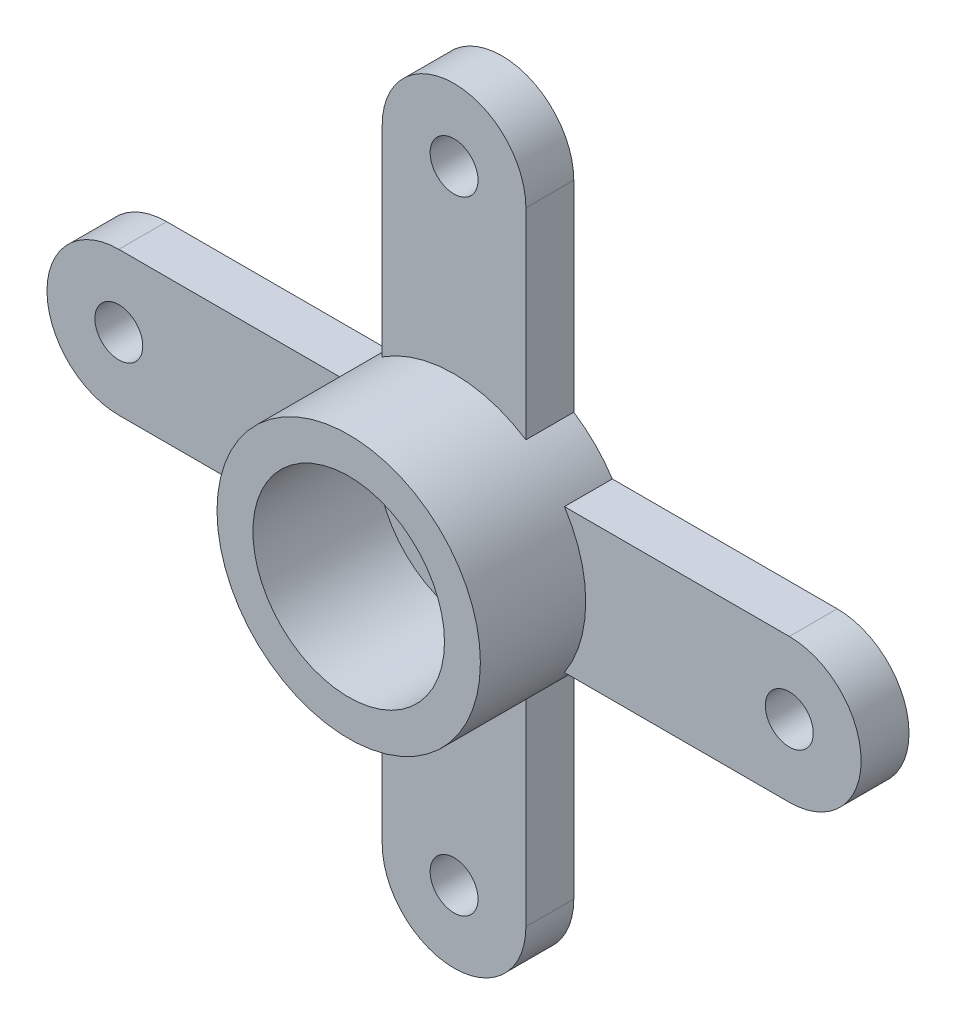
ISO-10303-21;
HEADER;
FILE_DESCRIPTION(('STEP AP214'),'2;1');
FILE_NAME('part.step','',(''),(''),'','','');
FILE_SCHEMA(('AUTOMOTIVE_DESIGN { 1 0 10303 214 1 1 1 1 }'));
ENDSEC;
DATA;
#1=APPLICATION_CONTEXT('core data for automotive mechanical design processes');
#2=APPLICATION_PROTOCOL_DEFINITION('international standard','automotive_design',2000,#1);
#3=PRODUCT_CONTEXT('',#1,'mechanical');
#4=PRODUCT('Part','Part','',(#3));
#5=PRODUCT_RELATED_PRODUCT_CATEGORY('part','',(#4));
#6=PRODUCT_DEFINITION_FORMATION('','',#4);
#7=PRODUCT_DEFINITION_CONTEXT('part definition',#1,'design');
#8=PRODUCT_DEFINITION('design','',#6,#7);
#9=PRODUCT_DEFINITION_SHAPE('','',#8);
#10=(LENGTH_UNIT() NAMED_UNIT(*) SI_UNIT(.MILLI.,.METRE.));
#11=(NAMED_UNIT(*) PLANE_ANGLE_UNIT() SI_UNIT($,.RADIAN.));
#12=(NAMED_UNIT(*) SI_UNIT($,.STERADIAN.) SOLID_ANGLE_UNIT());
#13=UNCERTAINTY_MEASURE_WITH_UNIT(LENGTH_MEASURE(1.E-05),#10,'distance_accuracy_value','');
#14=(GEOMETRIC_REPRESENTATION_CONTEXT(3) GLOBAL_UNCERTAINTY_ASSIGNED_CONTEXT((#13)) GLOBAL_UNIT_ASSIGNED_CONTEXT((#10,
#11,#12)) REPRESENTATION_CONTEXT('',''));
#15=CARTESIAN_POINT('',(0.,0.,0.));
#16=DIRECTION('',(0.,0.,1.));
#17=DIRECTION('',(1.,0.,0.));
#18=AXIS2_PLACEMENT_3D('',#15,#16,#17);
#19=CARTESIAN_POINT('',(0.,-6.5,1.));
#20=DIRECTION('',(0.,0.,1.));
#21=DIRECTION('',(1.,0.,0.));
#22=AXIS2_PLACEMENT_3D('',#19,#20,#21);
#23=PLANE('',#22);
#24=CARTESIAN_POINT('',(0.,0.,1.));
#25=DIRECTION('',(0.,0.,1.));
#26=DIRECTION('',(1.,0.,0.));
#27=AXIS2_PLACEMENT_3D('',#24,#25,#26);
#28=CIRCLE('',#27,2.75);
#29=CARTESIAN_POINT('',(1.5,2.30488611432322,1.));
#30=VERTEX_POINT('',#29);
#31=CARTESIAN_POINT('',(-1.5,2.30488611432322,1.));
#32=VERTEX_POINT('',#31);
#33=EDGE_CURVE('E191',#30,#32,#28,.T.);
#34=ORIENTED_EDGE('',*,*,#33,.F.);
#35=DIRECTION('',(0.,1.,0.));
#36=VECTOR('',#35,1.);
#37=CARTESIAN_POINT('',(1.5,1.5,1.));
#38=LINE('',#37,#36);
#39=CARTESIAN_POINT('',(1.5,6.5,1.));
#40=VERTEX_POINT('',#39);
#41=EDGE_CURVE('E231',#30,#40,#38,.T.);
#42=ORIENTED_EDGE('',*,*,#41,.T.);
#43=CARTESIAN_POINT('',(0.,6.5,1.));
#44=DIRECTION('',(0.,0.,1.));
#45=DIRECTION('',(1.,0.,0.));
#46=AXIS2_PLACEMENT_3D('',#43,#44,#45);
#47=CIRCLE('',#46,1.5);
#48=CARTESIAN_POINT('',(-1.5,6.5,1.));
#49=VERTEX_POINT('',#48);
#50=EDGE_CURVE('E233',#40,#49,#47,.T.);
#51=ORIENTED_EDGE('',*,*,#50,.T.);
#52=DIRECTION('',(0.,-1.,0.));
#53=VECTOR('',#52,1.);
#54=CARTESIAN_POINT('',(-1.5,1.5,1.));
#55=LINE('',#54,#53);
#56=EDGE_CURVE('E235',#49,#32,#55,.T.);
#57=ORIENTED_EDGE('',*,*,#56,.T.);
#58=EDGE_LOOP('',(#34,#42,#51,#57));
#59=FACE_BOUND('',#58,.T.);
#60=CARTESIAN_POINT('',(0.,6.5,1.));
#61=DIRECTION('',(0.,0.,1.));
#62=DIRECTION('',(1.,0.,0.));
#63=AXIS2_PLACEMENT_3D('',#60,#61,#62);
#64=CIRCLE('',#63,0.500000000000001);
#65=CARTESIAN_POINT('',(0.500000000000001,6.5,1.));
#66=VERTEX_POINT('',#65);
#67=EDGE_CURVE('E217',#66,#66,#64,.T.);
#68=ORIENTED_EDGE('',*,*,#67,.F.);
#69=EDGE_LOOP('',(#68));
#70=FACE_BOUND('',#69,.T.);
#71=ADVANCED_FACE('F34',(#59,#70),#23,.T.);
#72=CARTESIAN_POINT('',(-2.30488611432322,1.5,1.));
#73=VERTEX_POINT('',#72);
#74=CARTESIAN_POINT('',(-2.30488611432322,-1.5,1.));
#75=VERTEX_POINT('',#74);
#76=EDGE_CURVE('E184',#73,#75,#28,.T.);
#77=ORIENTED_EDGE('',*,*,#76,.F.);
#78=DIRECTION('',(-1.,0.,0.));
#79=VECTOR('',#78,1.);
#80=CARTESIAN_POINT('',(-7.,1.5,1.));
#81=LINE('',#80,#79);
#82=CARTESIAN_POINT('',(-7.,1.5,1.));
#83=VERTEX_POINT('',#82);
#84=EDGE_CURVE('E238',#73,#83,#81,.T.);
#85=ORIENTED_EDGE('',*,*,#84,.T.);
#86=CARTESIAN_POINT('',(-7.,0.,1.));
#87=DIRECTION('',(0.,0.,1.));
#88=DIRECTION('',(1.,0.,0.));
#89=AXIS2_PLACEMENT_3D('',#86,#87,#88);
#90=CIRCLE('',#89,1.5);
#91=CARTESIAN_POINT('',(-7.,-1.5,1.));
#92=VERTEX_POINT('',#91);
#93=EDGE_CURVE('E240',#83,#92,#90,.T.);
#94=ORIENTED_EDGE('',*,*,#93,.T.);
#95=DIRECTION('',(1.,0.,0.));
#96=VECTOR('',#95,1.);
#97=CARTESIAN_POINT('',(-7.,-1.5,1.));
#98=LINE('',#97,#96);
#99=EDGE_CURVE('E242',#92,#75,#98,.T.);
#100=ORIENTED_EDGE('',*,*,#99,.T.);
#101=EDGE_LOOP('',(#77,#85,#94,#100));
#102=FACE_BOUND('',#101,.T.);
#103=CARTESIAN_POINT('',(-7.,0.,1.));
#104=DIRECTION('',(0.,0.,1.));
#105=DIRECTION('',(1.,0.,0.));
#106=AXIS2_PLACEMENT_3D('',#103,#104,#105);
#107=CIRCLE('',#106,0.500000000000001);
#108=CARTESIAN_POINT('',(-6.5,0.,1.));
#109=VERTEX_POINT('',#108);
#110=EDGE_CURVE('E211',#109,#109,#107,.T.);
#111=ORIENTED_EDGE('',*,*,#110,.F.);
#112=EDGE_LOOP('',(#111));
#113=FACE_BOUND('',#112,.T.);
#114=ADVANCED_FACE('F312',(#102,#113),#23,.T.);
#115=CARTESIAN_POINT('',(-1.5,-2.30488611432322,1.));
#116=VERTEX_POINT('',#115);
#117=CARTESIAN_POINT('',(1.5,-2.30488611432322,1.));
#118=VERTEX_POINT('',#117);
#119=EDGE_CURVE('E175',#116,#118,#28,.T.);
#120=ORIENTED_EDGE('',*,*,#119,.F.);
#121=DIRECTION('',(0.,-1.,0.));
#122=VECTOR('',#121,1.);
#123=CARTESIAN_POINT('',(-1.5,-1.5,1.));
#124=LINE('',#123,#122);
#125=CARTESIAN_POINT('',(-1.5,-6.5,1.));
#126=VERTEX_POINT('',#125);
#127=EDGE_CURVE('E163',#116,#126,#124,.T.);
#128=ORIENTED_EDGE('',*,*,#127,.T.);
#129=CARTESIAN_POINT('',(0.,-6.5,1.));
#130=DIRECTION('',(0.,0.,1.));
#131=DIRECTION('',(1.,0.,0.));
#132=AXIS2_PLACEMENT_3D('',#129,#130,#131);
#133=CIRCLE('',#132,1.5);
#134=CARTESIAN_POINT('',(1.5,-6.5,1.));
#135=VERTEX_POINT('',#134);
#136=EDGE_CURVE('E246',#126,#135,#133,.T.);
#137=ORIENTED_EDGE('',*,*,#136,.T.);
#138=DIRECTION('',(0.,1.,0.));
#139=VECTOR('',#138,1.);
#140=CARTESIAN_POINT('',(1.5,-1.5,1.));
#141=LINE('',#140,#139);
#142=EDGE_CURVE('E222',#135,#118,#141,.T.);
#143=ORIENTED_EDGE('',*,*,#142,.T.);
#144=EDGE_LOOP('',(#120,#128,#137,#143));
#145=FACE_BOUND('',#144,.T.);
#146=CARTESIAN_POINT('',(0.,-6.5,1.));
#147=DIRECTION('',(0.,0.,1.));
#148=DIRECTION('',(1.,0.,0.));
#149=AXIS2_PLACEMENT_3D('',#146,#147,#148);
#150=CIRCLE('',#149,0.500000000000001);
#151=CARTESIAN_POINT('',(0.500000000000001,-6.5,1.));
#152=VERTEX_POINT('',#151);
#153=EDGE_CURVE('E199',#152,#152,#150,.T.);
#154=ORIENTED_EDGE('',*,*,#153,.F.);
#155=EDGE_LOOP('',(#154));
#156=FACE_BOUND('',#155,.T.);
#157=ADVANCED_FACE('F355',(#145,#156),#23,.T.);
#158=CARTESIAN_POINT('',(2.30488611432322,-1.5,1.));
#159=VERTEX_POINT('',#158);
#160=CARTESIAN_POINT('',(2.30488611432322,1.5,1.));
#161=VERTEX_POINT('',#160);
#162=EDGE_CURVE('E183',#159,#161,#28,.T.);
#163=ORIENTED_EDGE('',*,*,#162,.F.);
#164=DIRECTION('',(1.,0.,0.));
#165=VECTOR('',#164,1.);
#166=CARTESIAN_POINT('',(7.,-1.5,1.));
#167=LINE('',#166,#165);
#168=CARTESIAN_POINT('',(7.,-1.5,1.));
#169=VERTEX_POINT('',#168);
#170=EDGE_CURVE('E224',#159,#169,#167,.T.);
#171=ORIENTED_EDGE('',*,*,#170,.T.);
#172=CARTESIAN_POINT('',(7.,0.,1.));
#173=DIRECTION('',(0.,0.,1.));
#174=DIRECTION('',(1.,0.,0.));
#175=AXIS2_PLACEMENT_3D('',#172,#173,#174);
#176=CIRCLE('',#175,1.5);
#177=CARTESIAN_POINT('',(7.,1.5,1.));
#178=VERTEX_POINT('',#177);
#179=EDGE_CURVE('E226',#169,#178,#176,.T.);
#180=ORIENTED_EDGE('',*,*,#179,.T.);
#181=DIRECTION('',(-1.,0.,0.));
#182=VECTOR('',#181,1.);
#183=CARTESIAN_POINT('',(1.5,1.5,1.));
#184=LINE('',#183,#182);
#185=EDGE_CURVE('E228',#178,#161,#184,.T.);
#186=ORIENTED_EDGE('',*,*,#185,.T.);
#187=EDGE_LOOP('',(#163,#171,#180,#186));
#188=FACE_BOUND('',#187,.T.);
#189=CARTESIAN_POINT('',(7.,0.,1.));
#190=DIRECTION('',(0.,0.,1.));
#191=DIRECTION('',(1.,0.,0.));
#192=AXIS2_PLACEMENT_3D('',#189,#190,#191);
#193=CIRCLE('',#192,0.500000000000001);
#194=CARTESIAN_POINT('',(7.5,0.,1.));
#195=VERTEX_POINT('',#194);
#196=EDGE_CURVE('E205',#195,#195,#193,.T.);
#197=ORIENTED_EDGE('',*,*,#196,.F.);
#198=EDGE_LOOP('',(#197));
#199=FACE_BOUND('',#198,.T.);
#200=ADVANCED_FACE('F351',(#188,#199),#23,.T.);
#201=CARTESIAN_POINT('',(0.,-6.5,0.));
#202=DIRECTION('',(0.,0.,1.));
#203=DIRECTION('',(1.,0.,0.));
#204=AXIS2_PLACEMENT_3D('',#201,#202,#203);
#205=PLANE('',#204);
#206=CARTESIAN_POINT('',(7.,0.,0.));
#207=DIRECTION('',(0.,0.,1.));
#208=DIRECTION('',(1.,0.,0.));
#209=AXIS2_PLACEMENT_3D('',#206,#207,#208);
#210=CIRCLE('',#209,0.500000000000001);
#211=CARTESIAN_POINT('',(7.5,0.,0.));
#212=VERTEX_POINT('',#211);
#213=EDGE_CURVE('E202',#212,#212,#210,.T.);
#214=ORIENTED_EDGE('',*,*,#213,.T.);
#215=EDGE_LOOP('',(#214));
#216=FACE_BOUND('',#215,.T.);
#217=DIRECTION('',(1.,0.,0.));
#218=VECTOR('',#217,1.);
#219=CARTESIAN_POINT('',(7.,-1.5,0.));
#220=LINE('',#219,#218);
#221=CARTESIAN_POINT('',(2.30488611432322,-1.5,0.));
#222=VERTEX_POINT('',#221);
#223=CARTESIAN_POINT('',(7.,-1.5,0.));
#224=VERTEX_POINT('',#223);
#225=EDGE_CURVE('E250',#222,#224,#220,.T.);
#226=ORIENTED_EDGE('',*,*,#225,.F.);
#227=CARTESIAN_POINT('',(0.,0.,0.));
#228=DIRECTION('',(0.,0.,1.));
#229=DIRECTION('',(1.,0.,0.));
#230=AXIS2_PLACEMENT_3D('',#227,#228,#229);
#231=CIRCLE('',#230,2.75);
#232=CARTESIAN_POINT('',(1.5,-2.30488611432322,0.));
#233=VERTEX_POINT('',#232);
#234=EDGE_CURVE('E171',#222,#233,#231,.F.);
#235=ORIENTED_EDGE('',*,*,#234,.T.);
#236=DIRECTION('',(0.,1.,0.));
#237=VECTOR('',#236,1.);
#238=CARTESIAN_POINT('',(1.5,-1.5,0.));
#239=LINE('',#238,#237);
#240=CARTESIAN_POINT('',(1.5,-6.5,0.));
#241=VERTEX_POINT('',#240);
#242=EDGE_CURVE('E54',#241,#233,#239,.T.);
#243=ORIENTED_EDGE('',*,*,#242,.F.);
#244=CARTESIAN_POINT('',(0.,-6.5,0.));
#245=DIRECTION('',(0.,0.,1.));
#246=DIRECTION('',(1.,0.,0.));
#247=AXIS2_PLACEMENT_3D('',#244,#245,#246);
#248=CIRCLE('',#247,1.5);
#249=CARTESIAN_POINT('',(-1.5,-6.5,0.));
#250=VERTEX_POINT('',#249);
#251=EDGE_CURVE('E154',#250,#241,#248,.T.);
#252=ORIENTED_EDGE('',*,*,#251,.F.);
#253=DIRECTION('',(0.,-1.,0.));
#254=VECTOR('',#253,1.);
#255=CARTESIAN_POINT('',(-1.5,-1.5,0.));
#256=LINE('',#255,#254);
#257=CARTESIAN_POINT('',(-1.5,-2.30488611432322,0.));
#258=VERTEX_POINT('',#257);
#259=EDGE_CURVE('E147',#258,#250,#256,.T.);
#260=ORIENTED_EDGE('',*,*,#259,.F.);
#261=CARTESIAN_POINT('',(-2.30488611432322,-1.5,0.));
#262=VERTEX_POINT('',#261);
#263=EDGE_CURVE('E153',#258,#262,#231,.F.);
#264=ORIENTED_EDGE('',*,*,#263,.T.);
#265=DIRECTION('',(1.,0.,0.));
#266=VECTOR('',#265,1.);
#267=CARTESIAN_POINT('',(-7.,-1.5,0.));
#268=LINE('',#267,#266);
#269=CARTESIAN_POINT('',(-7.,-1.5,0.));
#270=VERTEX_POINT('',#269);
#271=EDGE_CURVE('E158',#270,#262,#268,.T.);
#272=ORIENTED_EDGE('',*,*,#271,.F.);
#273=CARTESIAN_POINT('',(-7.,0.,0.));
#274=DIRECTION('',(0.,0.,1.));
#275=DIRECTION('',(1.,0.,0.));
#276=AXIS2_PLACEMENT_3D('',#273,#274,#275);
#277=CIRCLE('',#276,1.5);
#278=CARTESIAN_POINT('',(-7.,1.5,0.));
#279=VERTEX_POINT('',#278);
#280=EDGE_CURVE('E264',#279,#270,#277,.T.);
#281=ORIENTED_EDGE('',*,*,#280,.F.);
#282=DIRECTION('',(-1.,0.,0.));
#283=VECTOR('',#282,1.);
#284=CARTESIAN_POINT('',(-7.,1.5,0.));
#285=LINE('',#284,#283);
#286=CARTESIAN_POINT('',(-2.30488611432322,1.5,0.));
#287=VERTEX_POINT('',#286);
#288=EDGE_CURVE('E262',#287,#279,#285,.T.);
#289=ORIENTED_EDGE('',*,*,#288,.F.);
#290=CARTESIAN_POINT('',(-1.5,2.30488611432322,0.));
#291=VERTEX_POINT('',#290);
#292=EDGE_CURVE('E172',#287,#291,#231,.F.);
#293=ORIENTED_EDGE('',*,*,#292,.T.);
#294=DIRECTION('',(0.,-1.,0.));
#295=VECTOR('',#294,1.);
#296=CARTESIAN_POINT('',(-1.5,1.5,0.));
#297=LINE('',#296,#295);
#298=CARTESIAN_POINT('',(-1.5,6.5,0.));
#299=VERTEX_POINT('',#298);
#300=EDGE_CURVE('E260',#299,#291,#297,.T.);
#301=ORIENTED_EDGE('',*,*,#300,.F.);
#302=CARTESIAN_POINT('',(0.,6.5,0.));
#303=DIRECTION('',(0.,0.,1.));
#304=DIRECTION('',(1.,0.,0.));
#305=AXIS2_PLACEMENT_3D('',#302,#303,#304);
#306=CIRCLE('',#305,1.5);
#307=CARTESIAN_POINT('',(1.5,6.5,0.));
#308=VERTEX_POINT('',#307);
#309=EDGE_CURVE('E258',#308,#299,#306,.T.);
#310=ORIENTED_EDGE('',*,*,#309,.F.);
#311=DIRECTION('',(0.,1.,0.));
#312=VECTOR('',#311,1.);
#313=CARTESIAN_POINT('',(1.5,1.5,0.));
#314=LINE('',#313,#312);
#315=CARTESIAN_POINT('',(1.5,2.30488611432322,0.));
#316=VERTEX_POINT('',#315);
#317=EDGE_CURVE('E256',#316,#308,#314,.T.);
#318=ORIENTED_EDGE('',*,*,#317,.F.);
#319=CARTESIAN_POINT('',(2.30488611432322,1.5,0.));
#320=VERTEX_POINT('',#319);
#321=EDGE_CURVE('E176',#316,#320,#231,.F.);
#322=ORIENTED_EDGE('',*,*,#321,.T.);
#323=DIRECTION('',(-1.,0.,0.));
#324=VECTOR('',#323,1.);
#325=CARTESIAN_POINT('',(1.5,1.5,0.));
#326=LINE('',#325,#324);
#327=CARTESIAN_POINT('',(7.,1.5,0.));
#328=VERTEX_POINT('',#327);
#329=EDGE_CURVE('E254',#328,#320,#326,.T.);
#330=ORIENTED_EDGE('',*,*,#329,.F.);
#331=CARTESIAN_POINT('',(7.,0.,0.));
#332=DIRECTION('',(0.,0.,1.));
#333=DIRECTION('',(1.,0.,0.));
#334=AXIS2_PLACEMENT_3D('',#331,#332,#333);
#335=CIRCLE('',#334,1.5);
#336=EDGE_CURVE('E252',#224,#328,#335,.T.);
#337=ORIENTED_EDGE('',*,*,#336,.F.);
#338=EDGE_LOOP('',(#226,#235,#243,#252,#260,#264,#272,#281,#289,#293,#301,#310,#318,#322,#330,#337));
#339=FACE_BOUND('',#338,.T.);
#340=CARTESIAN_POINT('',(0.,-6.5,0.));
#341=DIRECTION('',(0.,0.,1.));
#342=DIRECTION('',(1.,0.,0.));
#343=AXIS2_PLACEMENT_3D('',#340,#341,#342);
#344=CIRCLE('',#343,0.500000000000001);
#345=CARTESIAN_POINT('',(0.500000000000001,-6.5,0.));
#346=VERTEX_POINT('',#345);
#347=EDGE_CURVE('E198',#346,#346,#344,.T.);
#348=ORIENTED_EDGE('',*,*,#347,.T.);
#349=EDGE_LOOP('',(#348));
#350=FACE_BOUND('',#349,.T.);
#351=CARTESIAN_POINT('',(-7.,0.,0.));
#352=DIRECTION('',(0.,0.,1.));
#353=DIRECTION('',(1.,0.,0.));
#354=AXIS2_PLACEMENT_3D('',#351,#352,#353);
#355=CIRCLE('',#354,0.500000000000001);
#356=CARTESIAN_POINT('',(-6.5,0.,0.));
#357=VERTEX_POINT('',#356);
#358=EDGE_CURVE('E208',#357,#357,#355,.T.);
#359=ORIENTED_EDGE('',*,*,#358,.T.);
#360=EDGE_LOOP('',(#359));
#361=FACE_BOUND('',#360,.T.);
#362=CARTESIAN_POINT('',(0.,6.5,0.));
#363=DIRECTION('',(0.,0.,1.));
#364=DIRECTION('',(1.,0.,0.));
#365=AXIS2_PLACEMENT_3D('',#362,#363,#364);
#366=CIRCLE('',#365,0.500000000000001);
#367=CARTESIAN_POINT('',(0.500000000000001,6.5,0.));
#368=VERTEX_POINT('',#367);
#369=EDGE_CURVE('E214',#368,#368,#366,.T.);
#370=ORIENTED_EDGE('',*,*,#369,.T.);
#371=EDGE_LOOP('',(#370));
#372=FACE_BOUND('',#371,.T.);
#373=ADVANCED_FACE('F149',(#216,#339,#350,#361,#372),#205,.F.);
#374=CARTESIAN_POINT('',(1.5,-1.5,1.));
#375=DIRECTION('',(-1.,0.,0.));
#376=DIRECTION('',(0.,0.,1.));
#377=AXIS2_PLACEMENT_3D('',#374,#375,#376);
#378=PLANE('',#377);
#379=ORIENTED_EDGE('',*,*,#242,.T.);
#380=DIRECTION('',(0.,0.,1.));
#381=VECTOR('',#380,1.);
#382=CARTESIAN_POINT('',(1.5,-2.30488611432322,-7.77817459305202));
#383=LINE('',#382,#381);
#384=EDGE_CURVE('E49',#233,#118,#383,.T.);
#385=ORIENTED_EDGE('',*,*,#384,.T.);
#386=ORIENTED_EDGE('',*,*,#142,.F.);
#387=DIRECTION('',(0.,0.,-1.));
#388=VECTOR('',#387,1.);
#389=CARTESIAN_POINT('',(1.5,-6.5,1.));
#390=LINE('',#389,#388);
#391=EDGE_CURVE('E248',#135,#241,#390,.T.);
#392=ORIENTED_EDGE('',*,*,#391,.T.);
#393=EDGE_LOOP('',(#379,#385,#386,#392));
#394=FACE_BOUND('',#393,.T.);
#395=ADVANCED_FACE('F36',(#394),#378,.F.);
#396=CARTESIAN_POINT('',(7.,-1.5,1.));
#397=DIRECTION('',(0.,1.,0.));
#398=DIRECTION('',(-1.,0.,0.));
#399=AXIS2_PLACEMENT_3D('',#396,#397,#398);
#400=PLANE('',#399);
#401=ORIENTED_EDGE('',*,*,#170,.F.);
#402=DIRECTION('',(0.,0.,1.));
#403=VECTOR('',#402,1.);
#404=CARTESIAN_POINT('',(2.30488611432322,-1.5,-7.77817459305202));
#405=LINE('',#404,#403);
#406=EDGE_CURVE('E196',#159,#222,#405,.F.);
#407=ORIENTED_EDGE('',*,*,#406,.T.);
#408=ORIENTED_EDGE('',*,*,#225,.T.);
#409=DIRECTION('',(0.,0.,-1.));
#410=VECTOR('',#409,1.);
#411=CARTESIAN_POINT('',(7.,-1.5,1.));
#412=LINE('',#411,#410);
#413=EDGE_CURVE('E42',#169,#224,#412,.T.);
#414=ORIENTED_EDGE('',*,*,#413,.F.);
#415=EDGE_LOOP('',(#401,#407,#408,#414));
#416=FACE_BOUND('',#415,.T.);
#417=ADVANCED_FACE('F524',(#416),#400,.F.);
#418=CARTESIAN_POINT('',(7.,0.,1.));
#419=DIRECTION('',(0.,0.,-1.));
#420=DIRECTION('',(-1.,0.,0.));
#421=AXIS2_PLACEMENT_3D('',#418,#419,#420);
#422=CYLINDRICAL_SURFACE('',#421,1.5);
#423=ORIENTED_EDGE('',*,*,#336,.T.);
#424=DIRECTION('',(0.,0.,-1.));
#425=VECTOR('',#424,1.);
#426=CARTESIAN_POINT('',(7.,1.5,1.));
#427=LINE('',#426,#425);
#428=EDGE_CURVE('E283',#178,#328,#427,.T.);
#429=ORIENTED_EDGE('',*,*,#428,.F.);
#430=ORIENTED_EDGE('',*,*,#179,.F.);
#431=ORIENTED_EDGE('',*,*,#413,.T.);
#432=EDGE_LOOP('',(#423,#429,#430,#431));
#433=FACE_BOUND('',#432,.T.);
#434=ADVANCED_FACE('F290',(#433),#422,.T.);
#435=CARTESIAN_POINT('',(1.5,1.5,1.));
#436=DIRECTION('',(0.,-1.,0.));
#437=DIRECTION('',(1.,0.,0.));
#438=AXIS2_PLACEMENT_3D('',#435,#436,#437);
#439=PLANE('',#438);
#440=ORIENTED_EDGE('',*,*,#329,.T.);
#441=DIRECTION('',(0.,0.,1.));
#442=VECTOR('',#441,1.);
#443=CARTESIAN_POINT('',(2.30488611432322,1.5,-7.77817459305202));
#444=LINE('',#443,#442);
#445=EDGE_CURVE('E194',#320,#161,#444,.T.);
#446=ORIENTED_EDGE('',*,*,#445,.T.);
#447=ORIENTED_EDGE('',*,*,#185,.F.);
#448=ORIENTED_EDGE('',*,*,#428,.T.);
#449=EDGE_LOOP('',(#440,#446,#447,#448));
#450=FACE_BOUND('',#449,.T.);
#451=ADVANCED_FACE('F301',(#450),#439,.F.);
#452=CARTESIAN_POINT('',(1.5,1.5,1.));
#453=DIRECTION('',(-1.,0.,0.));
#454=DIRECTION('',(0.,0.,1.));
#455=AXIS2_PLACEMENT_3D('',#452,#453,#454);
#456=PLANE('',#455);
#457=ORIENTED_EDGE('',*,*,#41,.F.);
#458=DIRECTION('',(0.,0.,1.));
#459=VECTOR('',#458,1.);
#460=CARTESIAN_POINT('',(1.5,2.30488611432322,-7.77817459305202));
#461=LINE('',#460,#459);
#462=EDGE_CURVE('E192',#30,#316,#461,.F.);
#463=ORIENTED_EDGE('',*,*,#462,.T.);
#464=ORIENTED_EDGE('',*,*,#317,.T.);
#465=DIRECTION('',(0.,0.,-1.));
#466=VECTOR('',#465,1.);
#467=CARTESIAN_POINT('',(1.5,6.5,1.));
#468=LINE('',#467,#466);
#469=EDGE_CURVE('E280',#40,#308,#468,.T.);
#470=ORIENTED_EDGE('',*,*,#469,.F.);
#471=EDGE_LOOP('',(#457,#463,#464,#470));
#472=FACE_BOUND('',#471,.T.);
#473=ADVANCED_FACE('F340',(#472),#456,.F.);
#474=CARTESIAN_POINT('',(0.,6.5,1.));
#475=DIRECTION('',(0.,0.,-1.));
#476=DIRECTION('',(-1.,0.,0.));
#477=AXIS2_PLACEMENT_3D('',#474,#475,#476);
#478=CYLINDRICAL_SURFACE('',#477,1.5);
#479=ORIENTED_EDGE('',*,*,#309,.T.);
#480=DIRECTION('',(0.,0.,-1.));
#481=VECTOR('',#480,1.);
#482=CARTESIAN_POINT('',(-1.5,6.5,1.));
#483=LINE('',#482,#481);
#484=EDGE_CURVE('E277',#49,#299,#483,.T.);
#485=ORIENTED_EDGE('',*,*,#484,.F.);
#486=ORIENTED_EDGE('',*,*,#50,.F.);
#487=ORIENTED_EDGE('',*,*,#469,.T.);
#488=EDGE_LOOP('',(#479,#485,#486,#487));
#489=FACE_BOUND('',#488,.T.);
#490=ADVANCED_FACE('F337',(#489),#478,.T.);
#491=CARTESIAN_POINT('',(-1.5,1.5,1.));
#492=DIRECTION('',(1.,0.,0.));
#493=DIRECTION('',(0.,0.,-1.));
#494=AXIS2_PLACEMENT_3D('',#491,#492,#493);
#495=PLANE('',#494);
#496=ORIENTED_EDGE('',*,*,#300,.T.);
#497=DIRECTION('',(0.,0.,1.));
#498=VECTOR('',#497,1.);
#499=CARTESIAN_POINT('',(-1.5,2.30488611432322,-7.77817459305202));
#500=LINE('',#499,#498);
#501=EDGE_CURVE('E189',#291,#32,#500,.T.);
#502=ORIENTED_EDGE('',*,*,#501,.T.);
#503=ORIENTED_EDGE('',*,*,#56,.F.);
#504=ORIENTED_EDGE('',*,*,#484,.T.);
#505=EDGE_LOOP('',(#496,#502,#503,#504));
#506=FACE_BOUND('',#505,.T.);
#507=ADVANCED_FACE('F329',(#506),#495,.F.);
#508=CARTESIAN_POINT('',(-7.,1.5,1.));
#509=DIRECTION('',(0.,-1.,0.));
#510=DIRECTION('',(0.,0.,-1.));
#511=AXIS2_PLACEMENT_3D('',#508,#509,#510);
#512=PLANE('',#511);
#513=ORIENTED_EDGE('',*,*,#84,.F.);
#514=DIRECTION('',(0.,0.,1.));
#515=VECTOR('',#514,1.);
#516=CARTESIAN_POINT('',(-2.30488611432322,1.5,-7.77817459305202));
#517=LINE('',#516,#515);
#518=EDGE_CURVE('E187',#73,#287,#517,.F.);
#519=ORIENTED_EDGE('',*,*,#518,.T.);
#520=ORIENTED_EDGE('',*,*,#288,.T.);
#521=DIRECTION('',(0.,0.,-1.));
#522=VECTOR('',#521,1.);
#523=CARTESIAN_POINT('',(-7.,1.5,1.));
#524=LINE('',#523,#522);
#525=EDGE_CURVE('E274',#83,#279,#524,.T.);
#526=ORIENTED_EDGE('',*,*,#525,.F.);
#527=EDGE_LOOP('',(#513,#519,#520,#526));
#528=FACE_BOUND('',#527,.T.);
#529=ADVANCED_FACE('F317',(#528),#512,.F.);
#530=CARTESIAN_POINT('',(-7.,0.,1.));
#531=DIRECTION('',(0.,0.,-1.));
#532=DIRECTION('',(-1.,0.,0.));
#533=AXIS2_PLACEMENT_3D('',#530,#531,#532);
#534=CYLINDRICAL_SURFACE('',#533,1.5);
#535=ORIENTED_EDGE('',*,*,#280,.T.);
#536=DIRECTION('',(0.,0.,-1.));
#537=VECTOR('',#536,1.);
#538=CARTESIAN_POINT('',(-7.,-1.5,1.));
#539=LINE('',#538,#537);
#540=EDGE_CURVE('E271',#92,#270,#539,.T.);
#541=ORIENTED_EDGE('',*,*,#540,.F.);
#542=ORIENTED_EDGE('',*,*,#93,.F.);
#543=ORIENTED_EDGE('',*,*,#525,.T.);
#544=EDGE_LOOP('',(#535,#541,#542,#543));
#545=FACE_BOUND('',#544,.T.);
#546=ADVANCED_FACE('F323',(#545),#534,.T.);
#547=CARTESIAN_POINT('',(-7.,-1.5,1.));
#548=DIRECTION('',(0.,1.,0.));
#549=DIRECTION('',(0.,0.,1.));
#550=AXIS2_PLACEMENT_3D('',#547,#548,#549);
#551=PLANE('',#550);
#552=ORIENTED_EDGE('',*,*,#271,.T.);
#553=DIRECTION('',(0.,0.,1.));
#554=VECTOR('',#553,1.);
#555=CARTESIAN_POINT('',(-2.30488611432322,-1.5,-7.77817459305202));
#556=LINE('',#555,#554);
#557=EDGE_CURVE('E170',#262,#75,#556,.T.);
#558=ORIENTED_EDGE('',*,*,#557,.T.);
#559=ORIENTED_EDGE('',*,*,#99,.F.);
#560=ORIENTED_EDGE('',*,*,#540,.T.);
#561=EDGE_LOOP('',(#552,#558,#559,#560));
#562=FACE_BOUND('',#561,.T.);
#563=ADVANCED_FACE('F325',(#562),#551,.F.);
#564=CARTESIAN_POINT('',(-1.5,-1.5,1.));
#565=DIRECTION('',(1.,0.,0.));
#566=DIRECTION('',(0.,0.,-1.));
#567=AXIS2_PLACEMENT_3D('',#564,#565,#566);
#568=PLANE('',#567);
#569=ORIENTED_EDGE('',*,*,#127,.F.);
#570=DIRECTION('',(0.,0.,1.));
#571=VECTOR('',#570,1.);
#572=CARTESIAN_POINT('',(-1.5,-2.30488611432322,-7.77817459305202));
#573=LINE('',#572,#571);
#574=EDGE_CURVE('E11',#116,#258,#573,.F.);
#575=ORIENTED_EDGE('',*,*,#574,.T.);
#576=ORIENTED_EDGE('',*,*,#259,.T.);
#577=DIRECTION('',(0.,0.,-1.));
#578=VECTOR('',#577,1.);
#579=CARTESIAN_POINT('',(-1.5,-6.5,1.));
#580=LINE('',#579,#578);
#581=EDGE_CURVE('E269',#126,#250,#580,.T.);
#582=ORIENTED_EDGE('',*,*,#581,.F.);
#583=EDGE_LOOP('',(#569,#575,#576,#582));
#584=FACE_BOUND('',#583,.T.);
#585=ADVANCED_FACE('F162',(#584),#568,.F.);
#586=CARTESIAN_POINT('',(0.,-6.5,1.));
#587=DIRECTION('',(0.,0.,-1.));
#588=DIRECTION('',(-1.,0.,0.));
#589=AXIS2_PLACEMENT_3D('',#586,#587,#588);
#590=CYLINDRICAL_SURFACE('',#589,1.5);
#591=ORIENTED_EDGE('',*,*,#251,.T.);
#592=ORIENTED_EDGE('',*,*,#391,.F.);
#593=ORIENTED_EDGE('',*,*,#136,.F.);
#594=ORIENTED_EDGE('',*,*,#581,.T.);
#595=EDGE_LOOP('',(#591,#592,#593,#594));
#596=FACE_BOUND('',#595,.T.);
#597=ADVANCED_FACE('F386',(#596),#590,.T.);
#598=CARTESIAN_POINT('',(0.,6.5,1.));
#599=DIRECTION('',(0.,0.,-1.));
#600=DIRECTION('',(-1.,0.,0.));
#601=AXIS2_PLACEMENT_3D('',#598,#599,#600);
#602=CYLINDRICAL_SURFACE('',#601,0.500000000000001);
#603=ORIENTED_EDGE('',*,*,#67,.T.);
#604=EDGE_LOOP('',(#603));
#605=FACE_BOUND('',#604,.T.);
#606=ORIENTED_EDGE('',*,*,#369,.F.);
#607=EDGE_LOOP('',(#606));
#608=FACE_BOUND('',#607,.T.);
#609=ADVANCED_FACE('F381',(#605,#608),#602,.F.);
#610=CARTESIAN_POINT('',(-7.,0.,1.));
#611=DIRECTION('',(0.,0.,-1.));
#612=DIRECTION('',(-1.,0.,0.));
#613=AXIS2_PLACEMENT_3D('',#610,#611,#612);
#614=CYLINDRICAL_SURFACE('',#613,0.500000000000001);
#615=ORIENTED_EDGE('',*,*,#110,.T.);
#616=EDGE_LOOP('',(#615));
#617=FACE_BOUND('',#616,.T.);
#618=ORIENTED_EDGE('',*,*,#358,.F.);
#619=EDGE_LOOP('',(#618));
#620=FACE_BOUND('',#619,.T.);
#621=ADVANCED_FACE('F372',(#617,#620),#614,.F.);
#622=CARTESIAN_POINT('',(7.,0.,1.));
#623=DIRECTION('',(0.,0.,-1.));
#624=DIRECTION('',(-1.,0.,0.));
#625=AXIS2_PLACEMENT_3D('',#622,#623,#624);
#626=CYLINDRICAL_SURFACE('',#625,0.500000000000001);
#627=ORIENTED_EDGE('',*,*,#196,.T.);
#628=EDGE_LOOP('',(#627));
#629=FACE_BOUND('',#628,.T.);
#630=ORIENTED_EDGE('',*,*,#213,.F.);
#631=EDGE_LOOP('',(#630));
#632=FACE_BOUND('',#631,.T.);
#633=ADVANCED_FACE('F368',(#629,#632),#626,.F.);
#634=CARTESIAN_POINT('',(0.,-6.5,1.));
#635=DIRECTION('',(0.,0.,-1.));
#636=DIRECTION('',(-1.,0.,0.));
#637=AXIS2_PLACEMENT_3D('',#634,#635,#636);
#638=CYLINDRICAL_SURFACE('',#637,0.500000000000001);
#639=ORIENTED_EDGE('',*,*,#153,.T.);
#640=EDGE_LOOP('',(#639));
#641=FACE_BOUND('',#640,.T.);
#642=ORIENTED_EDGE('',*,*,#347,.F.);
#643=EDGE_LOOP('',(#642));
#644=FACE_BOUND('',#643,.T.);
#645=ADVANCED_FACE('F371',(#641,#644),#638,.F.);
#646=CARTESIAN_POINT('',(0.,0.,-7.77817459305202));
#647=DIRECTION('',(0.,0.,1.));
#648=DIRECTION('',(1.,0.,0.));
#649=AXIS2_PLACEMENT_3D('',#646,#647,#648);
#650=CYLINDRICAL_SURFACE('',#649,2.75);
#651=CARTESIAN_POINT('',(0.,0.,3.2));
#652=DIRECTION('',(0.,0.,1.));
#653=DIRECTION('',(1.,0.,0.));
#654=AXIS2_PLACEMENT_3D('',#651,#652,#653);
#655=CIRCLE('',#654,2.75);
#656=CARTESIAN_POINT('',(2.75,0.,3.2));
#657=VERTEX_POINT('',#656);
#658=EDGE_CURVE('E180',#657,#657,#655,.T.);
#659=ORIENTED_EDGE('',*,*,#658,.F.);
#660=EDGE_LOOP('',(#659));
#661=FACE_BOUND('',#660,.T.);
#662=ORIENTED_EDGE('',*,*,#406,.F.);
#663=ORIENTED_EDGE('',*,*,#162,.T.);
#664=ORIENTED_EDGE('',*,*,#445,.F.);
#665=ORIENTED_EDGE('',*,*,#321,.F.);
#666=ORIENTED_EDGE('',*,*,#462,.F.);
#667=ORIENTED_EDGE('',*,*,#33,.T.);
#668=ORIENTED_EDGE('',*,*,#501,.F.);
#669=ORIENTED_EDGE('',*,*,#292,.F.);
#670=ORIENTED_EDGE('',*,*,#518,.F.);
#671=ORIENTED_EDGE('',*,*,#76,.T.);
#672=ORIENTED_EDGE('',*,*,#557,.F.);
#673=ORIENTED_EDGE('',*,*,#263,.F.);
#674=ORIENTED_EDGE('',*,*,#574,.F.);
#675=ORIENTED_EDGE('',*,*,#119,.T.);
#676=ORIENTED_EDGE('',*,*,#384,.F.);
#677=ORIENTED_EDGE('',*,*,#234,.F.);
#678=EDGE_LOOP('',(#662,#663,#664,#665,#666,#667,#668,#669,#670,#671,#672,#673,#674,#675,#676,#677));
#679=FACE_BOUND('',#678,.T.);
#680=ADVANCED_FACE('F168',(#661,#679),#650,.T.);
#681=CARTESIAN_POINT('',(0.,0.,3.2));
#682=DIRECTION('',(0.,0.,1.));
#683=DIRECTION('',(1.,0.,0.));
#684=AXIS2_PLACEMENT_3D('',#681,#682,#683);
#685=PLANE('',#684);
#686=CARTESIAN_POINT('',(0.,0.,3.2));
#687=DIRECTION('',(0.,0.,1.));
#688=DIRECTION('',(1.,0.,0.));
#689=AXIS2_PLACEMENT_3D('',#686,#687,#688);
#690=CIRCLE('',#689,2.);
#691=CARTESIAN_POINT('',(2.,0.,3.2));
#692=VERTEX_POINT('',#691);
#693=EDGE_CURVE('E476',#692,#692,#690,.T.);
#694=ORIENTED_EDGE('',*,*,#693,.F.);
#695=EDGE_LOOP('',(#694));
#696=FACE_BOUND('',#695,.T.);
#697=ORIENTED_EDGE('',*,*,#658,.T.);
#698=EDGE_LOOP('',(#697));
#699=FACE_BOUND('',#698,.T.);
#700=ADVANCED_FACE('F439',(#696,#699),#685,.T.);
#701=CARTESIAN_POINT('',(0.,0.,0.6));
#702=DIRECTION('',(0.,0.,1.));
#703=DIRECTION('',(1.,0.,0.));
#704=AXIS2_PLACEMENT_3D('',#701,#702,#703);
#705=CYLINDRICAL_SURFACE('',#704,2.);
#706=CARTESIAN_POINT('',(0.,0.,0.6));
#707=DIRECTION('',(0.,0.,1.));
#708=DIRECTION('',(1.,0.,0.));
#709=AXIS2_PLACEMENT_3D('',#706,#707,#708);
#710=CIRCLE('',#709,2.);
#711=CARTESIAN_POINT('',(2.,0.,0.6));
#712=VERTEX_POINT('',#711);
#713=EDGE_CURVE('E475',#712,#712,#710,.T.);
#714=ORIENTED_EDGE('',*,*,#713,.F.);
#715=EDGE_LOOP('',(#714));
#716=FACE_BOUND('',#715,.T.);
#717=ORIENTED_EDGE('',*,*,#693,.T.);
#718=EDGE_LOOP('',(#717));
#719=FACE_BOUND('',#718,.T.);
#720=ADVANCED_FACE('F449',(#716,#719),#705,.F.);
#721=CARTESIAN_POINT('',(0.,0.,0.6));
#722=DIRECTION('',(0.,0.,1.));
#723=DIRECTION('',(1.,0.,0.));
#724=AXIS2_PLACEMENT_3D('',#721,#722,#723);
#725=PLANE('',#724);
#726=ORIENTED_EDGE('',*,*,#713,.T.);
#727=EDGE_LOOP('',(#726));
#728=FACE_BOUND('',#727,.T.);
#729=ADVANCED_FACE('F459',(#728),#725,.T.);
#730=CLOSED_SHELL('',(#71,#114,#157,#200,#373,#395,#417,#434,#451,#473,#490,#507,#529,#546,#563,
#585,#597,#609,#621,#633,#645,#680,#700,#720,#729));
#731=MANIFOLD_SOLID_BREP('B2',#730);
#732=ADVANCED_BREP_SHAPE_REPRESENTATION('',(#18,#731),#14);
#733=SHAPE_DEFINITION_REPRESENTATION(#9,#732);
ENDSEC;
END-ISO-10303-21;
